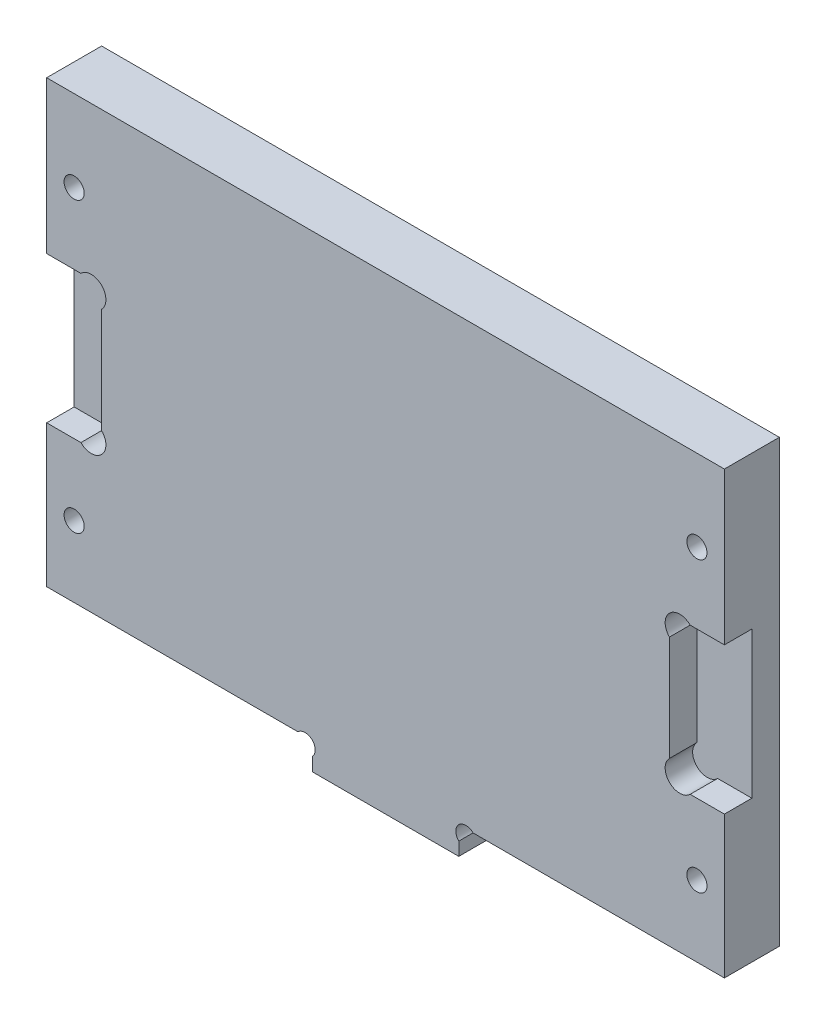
ISO-10303-21;
HEADER;
FILE_DESCRIPTION(('STEP AP214'),'2;1');
FILE_NAME('part.step','',(''),(''),'','','');
FILE_SCHEMA(('AUTOMOTIVE_DESIGN { 1 0 10303 214 1 1 1 1 }'));
ENDSEC;
DATA;
#1=APPLICATION_CONTEXT('core data for automotive mechanical design processes');
#2=APPLICATION_PROTOCOL_DEFINITION('international standard','automotive_design',2000,#1);
#3=PRODUCT_CONTEXT('',#1,'mechanical');
#4=PRODUCT('Part','Part','',(#3));
#5=PRODUCT_RELATED_PRODUCT_CATEGORY('part','',(#4));
#6=PRODUCT_DEFINITION_FORMATION('','',#4);
#7=PRODUCT_DEFINITION_CONTEXT('part definition',#1,'design');
#8=PRODUCT_DEFINITION('design','',#6,#7);
#9=PRODUCT_DEFINITION_SHAPE('','',#8);
#10=(LENGTH_UNIT() NAMED_UNIT(*) SI_UNIT(.MILLI.,.METRE.));
#11=(NAMED_UNIT(*) PLANE_ANGLE_UNIT() SI_UNIT($,.RADIAN.));
#12=(NAMED_UNIT(*) SI_UNIT($,.STERADIAN.) SOLID_ANGLE_UNIT());
#13=UNCERTAINTY_MEASURE_WITH_UNIT(LENGTH_MEASURE(1.E-05),#10,'distance_accuracy_value','');
#14=(GEOMETRIC_REPRESENTATION_CONTEXT(3) GLOBAL_UNCERTAINTY_ASSIGNED_CONTEXT((#13)) GLOBAL_UNIT_ASSIGNED_CONTEXT((#10,
#11,#12)) REPRESENTATION_CONTEXT('',''));
#15=CARTESIAN_POINT('',(0.,0.,0.));
#16=DIRECTION('',(0.,0.,1.));
#17=DIRECTION('',(1.,0.,0.));
#18=AXIS2_PLACEMENT_3D('',#15,#16,#17);
#19=CARTESIAN_POINT('',(28.2221825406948,2.2221825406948,6.));
#20=DIRECTION('',(0.,0.,-1.));
#21=DIRECTION('',(-1.,0.,0.));
#22=AXIS2_PLACEMENT_3D('',#19,#20,#21);
#23=PLANE('',#22);
#24=CARTESIAN_POINT('',(4.86862915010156,19.6313708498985,6.));
#25=DIRECTION('',(0.,0.,1.));
#26=DIRECTION('',(1.,0.,0.));
#27=AXIS2_PLACEMENT_3D('',#24,#25,#26);
#28=CIRCLE('',#27,1.59999999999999);
#29=CARTESIAN_POINT('',(3.73725830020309,18.5,6.));
#30=VERTEX_POINT('',#29);
#31=CARTESIAN_POINT('',(6.00000000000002,20.762741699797,6.));
#32=VERTEX_POINT('',#31);
#33=EDGE_CURVE('E191',#30,#32,#28,.T.);
#34=ORIENTED_EDGE('',*,*,#33,.F.);
#35=DIRECTION('',(1.,0.,0.));
#36=VECTOR('',#35,1.);
#37=CARTESIAN_POINT('',(3.73725830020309,18.5,6.));
#38=LINE('',#37,#36);
#39=CARTESIAN_POINT('',(0.,18.5,6.));
#40=VERTEX_POINT('',#39);
#41=EDGE_CURVE('E206',#40,#30,#38,.T.);
#42=ORIENTED_EDGE('',*,*,#41,.F.);
#43=DIRECTION('',(0.,-1.,0.));
#44=VECTOR('',#43,1.);
#45=CARTESIAN_POINT('',(0.,51.13,6.));
#46=LINE('',#45,#44);
#47=CARTESIAN_POINT('',(0.,3.,6.));
#48=VERTEX_POINT('',#47);
#49=EDGE_CURVE('E304',#40,#48,#46,.T.);
#50=ORIENTED_EDGE('',*,*,#49,.T.);
#51=DIRECTION('',(1.,0.,0.));
#52=VECTOR('',#51,1.);
#53=CARTESIAN_POINT('',(27.4443650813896,3.,6.));
#54=LINE('',#53,#52);
#55=CARTESIAN_POINT('',(27.4443650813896,3.,6.));
#56=VERTEX_POINT('',#55);
#57=EDGE_CURVE('E303',#48,#56,#54,.T.);
#58=ORIENTED_EDGE('',*,*,#57,.T.);
#59=CARTESIAN_POINT('',(28.2221825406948,2.2221825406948,6.));
#60=DIRECTION('',(0.,0.,-1.));
#61=DIRECTION('',(-1.,0.,0.));
#62=AXIS2_PLACEMENT_3D('',#59,#60,#61);
#63=CIRCLE('',#62,1.09999999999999);
#64=CARTESIAN_POINT('',(29.,1.4443650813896,6.));
#65=VERTEX_POINT('',#64);
#66=EDGE_CURVE('E306',#56,#65,#63,.T.);
#67=ORIENTED_EDGE('',*,*,#66,.T.);
#68=DIRECTION('',(0.,-1.,0.));
#69=VECTOR('',#68,1.);
#70=CARTESIAN_POINT('',(29.,1.4443650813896,6.));
#71=LINE('',#70,#69);
#72=CARTESIAN_POINT('',(29.,0.,6.));
#73=VERTEX_POINT('',#72);
#74=EDGE_CURVE('E308',#65,#73,#71,.T.);
#75=ORIENTED_EDGE('',*,*,#74,.T.);
#76=DIRECTION('',(1.,0.,0.));
#77=VECTOR('',#76,1.);
#78=CARTESIAN_POINT('',(29.,0.,6.));
#79=LINE('',#78,#77);
#80=CARTESIAN_POINT('',(45.,0.,6.));
#81=VERTEX_POINT('',#80);
#82=EDGE_CURVE('E310',#73,#81,#79,.T.);
#83=ORIENTED_EDGE('',*,*,#82,.T.);
#84=DIRECTION('',(0.,1.,0.));
#85=VECTOR('',#84,1.);
#86=CARTESIAN_POINT('',(45.,1.44436508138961,6.));
#87=LINE('',#86,#85);
#88=CARTESIAN_POINT('',(45.,1.4443650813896,6.));
#89=VERTEX_POINT('',#88);
#90=EDGE_CURVE('E312',#81,#89,#87,.T.);
#91=ORIENTED_EDGE('',*,*,#90,.T.);
#92=CARTESIAN_POINT('',(45.7778174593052,2.2221825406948,6.));
#93=DIRECTION('',(0.,0.,-1.));
#94=DIRECTION('',(1.,0.,0.));
#95=AXIS2_PLACEMENT_3D('',#92,#93,#94);
#96=CIRCLE('',#95,1.09999999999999);
#97=CARTESIAN_POINT('',(46.5556349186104,3.,6.));
#98=VERTEX_POINT('',#97);
#99=EDGE_CURVE('E314',#89,#98,#96,.T.);
#100=ORIENTED_EDGE('',*,*,#99,.T.);
#101=DIRECTION('',(1.,0.,0.));
#102=VECTOR('',#101,1.);
#103=CARTESIAN_POINT('',(46.5556349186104,3.,6.));
#104=LINE('',#103,#102);
#105=CARTESIAN_POINT('',(74.,3.00000000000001,6.));
#106=VERTEX_POINT('',#105);
#107=EDGE_CURVE('E316',#98,#106,#104,.T.);
#108=ORIENTED_EDGE('',*,*,#107,.T.);
#109=DIRECTION('',(0.,1.,0.));
#110=VECTOR('',#109,1.);
#111=CARTESIAN_POINT('',(74.,51.13,6.));
#112=LINE('',#111,#110);
#113=CARTESIAN_POINT('',(74.,18.5,6.));
#114=VERTEX_POINT('',#113);
#115=EDGE_CURVE('E319',#106,#114,#112,.T.);
#116=ORIENTED_EDGE('',*,*,#115,.T.);
#117=DIRECTION('',(1.,0.,0.));
#118=VECTOR('',#117,1.);
#119=CARTESIAN_POINT('',(70.2627416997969,18.5,6.));
#120=LINE('',#119,#118);
#121=CARTESIAN_POINT('',(70.2627416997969,18.5,6.));
#122=VERTEX_POINT('',#121);
#123=EDGE_CURVE('E259',#122,#114,#120,.T.);
#124=ORIENTED_EDGE('',*,*,#123,.F.);
#125=CARTESIAN_POINT('',(69.1313708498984,19.6313708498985,6.));
#126=DIRECTION('',(0.,0.,1.));
#127=DIRECTION('',(-1.,0.,0.));
#128=AXIS2_PLACEMENT_3D('',#125,#126,#127);
#129=CIRCLE('',#128,1.59999999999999);
#130=CARTESIAN_POINT('',(68.,20.762741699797,6.));
#131=VERTEX_POINT('',#130);
#132=EDGE_CURVE('E256',#131,#122,#129,.T.);
#133=ORIENTED_EDGE('',*,*,#132,.F.);
#134=DIRECTION('',(0.,-1.,0.));
#135=VECTOR('',#134,1.);
#136=CARTESIAN_POINT('',(68.,32.237258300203,6.));
#137=LINE('',#136,#135);
#138=CARTESIAN_POINT('',(68.,32.237258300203,6.));
#139=VERTEX_POINT('',#138);
#140=EDGE_CURVE('E253',#139,#131,#137,.T.);
#141=ORIENTED_EDGE('',*,*,#140,.F.);
#142=CARTESIAN_POINT('',(69.1313708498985,33.3686291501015,6.));
#143=DIRECTION('',(0.,0.,1.));
#144=DIRECTION('',(1.,0.,0.));
#145=AXIS2_PLACEMENT_3D('',#142,#143,#144);
#146=CIRCLE('',#145,1.59999999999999);
#147=CARTESIAN_POINT('',(70.2627416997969,34.5,6.));
#148=VERTEX_POINT('',#147);
#149=EDGE_CURVE('E226',#148,#139,#146,.T.);
#150=ORIENTED_EDGE('',*,*,#149,.F.);
#151=DIRECTION('',(-1.,0.,0.));
#152=VECTOR('',#151,1.);
#153=CARTESIAN_POINT('',(70.2627416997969,34.5,6.));
#154=LINE('',#153,#152);
#155=CARTESIAN_POINT('',(74.,34.5,6.));
#156=VERTEX_POINT('',#155);
#157=EDGE_CURVE('E239',#156,#148,#154,.T.);
#158=ORIENTED_EDGE('',*,*,#157,.F.);
#159=CARTESIAN_POINT('',(74.,51.13,6.));
#160=VERTEX_POINT('',#159);
#161=EDGE_CURVE('E318',#156,#160,#112,.T.);
#162=ORIENTED_EDGE('',*,*,#161,.T.);
#163=DIRECTION('',(-1.,0.,0.));
#164=VECTOR('',#163,1.);
#165=CARTESIAN_POINT('',(0.,51.13,6.));
#166=LINE('',#165,#164);
#167=CARTESIAN_POINT('',(0.,51.13,6.));
#168=VERTEX_POINT('',#167);
#169=EDGE_CURVE('E322',#160,#168,#166,.T.);
#170=ORIENTED_EDGE('',*,*,#169,.T.);
#171=CARTESIAN_POINT('',(0.,34.5,6.));
#172=VERTEX_POINT('',#171);
#173=EDGE_CURVE('E300',#168,#172,#46,.T.);
#174=ORIENTED_EDGE('',*,*,#173,.T.);
#175=DIRECTION('',(-1.,0.,0.));
#176=VECTOR('',#175,1.);
#177=CARTESIAN_POINT('',(3.73725830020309,34.5,6.));
#178=LINE('',#177,#176);
#179=CARTESIAN_POINT('',(3.73725830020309,34.5,6.));
#180=VERTEX_POINT('',#179);
#181=EDGE_CURVE('E209',#180,#172,#178,.T.);
#182=ORIENTED_EDGE('',*,*,#181,.F.);
#183=CARTESIAN_POINT('',(4.86862915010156,33.3686291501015,6.));
#184=DIRECTION('',(0.,0.,1.));
#185=DIRECTION('',(-1.,0.,0.));
#186=AXIS2_PLACEMENT_3D('',#183,#184,#185);
#187=CIRCLE('',#186,1.59999999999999);
#188=CARTESIAN_POINT('',(6.00000000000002,32.237258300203,6.));
#189=VERTEX_POINT('',#188);
#190=EDGE_CURVE('E220',#189,#180,#187,.T.);
#191=ORIENTED_EDGE('',*,*,#190,.F.);
#192=DIRECTION('',(0.,1.,0.));
#193=VECTOR('',#192,1.);
#194=CARTESIAN_POINT('',(6.00000000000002,32.237258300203,6.));
#195=LINE('',#194,#193);
#196=EDGE_CURVE('E218',#32,#189,#195,.T.);
#197=ORIENTED_EDGE('',*,*,#196,.F.);
#198=EDGE_LOOP('',(#34,#42,#50,#58,#67,#75,#83,#91,#100,#108,#116,#124,#133,#141,#150,#158,#162,
#170,#174,#182,#191,#197));
#199=FACE_BOUND('',#198,.T.);
#200=CARTESIAN_POINT('',(71.,10.75,6.));
#201=DIRECTION('',(0.,0.,1.));
#202=DIRECTION('',(1.,0.,0.));
#203=AXIS2_PLACEMENT_3D('',#200,#201,#202);
#204=CIRCLE('',#203,1.10000000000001);
#205=CARTESIAN_POINT('',(72.1,10.75,6.));
#206=VERTEX_POINT('',#205);
#207=EDGE_CURVE('E294',#206,#206,#204,.T.);
#208=ORIENTED_EDGE('',*,*,#207,.F.);
#209=EDGE_LOOP('',(#208));
#210=FACE_BOUND('',#209,.T.);
#211=CARTESIAN_POINT('',(71.,42.25,6.));
#212=DIRECTION('',(0.,0.,1.));
#213=DIRECTION('',(-1.,0.,0.));
#214=AXIS2_PLACEMENT_3D('',#211,#212,#213);
#215=CIRCLE('',#214,1.10000000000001);
#216=CARTESIAN_POINT('',(69.9,42.25,6.));
#217=VERTEX_POINT('',#216);
#218=EDGE_CURVE('E288',#217,#217,#215,.T.);
#219=ORIENTED_EDGE('',*,*,#218,.F.);
#220=EDGE_LOOP('',(#219));
#221=FACE_BOUND('',#220,.T.);
#222=CARTESIAN_POINT('',(3.,10.75,6.));
#223=DIRECTION('',(0.,0.,1.));
#224=DIRECTION('',(-1.,0.,0.));
#225=AXIS2_PLACEMENT_3D('',#222,#223,#224);
#226=CIRCLE('',#225,1.1);
#227=CARTESIAN_POINT('',(1.9,10.75,6.));
#228=VERTEX_POINT('',#227);
#229=EDGE_CURVE('E282',#228,#228,#226,.T.);
#230=ORIENTED_EDGE('',*,*,#229,.F.);
#231=EDGE_LOOP('',(#230));
#232=FACE_BOUND('',#231,.T.);
#233=CARTESIAN_POINT('',(3.,42.25,6.));
#234=DIRECTION('',(0.,0.,1.));
#235=DIRECTION('',(1.,0.,0.));
#236=AXIS2_PLACEMENT_3D('',#233,#234,#235);
#237=CIRCLE('',#236,1.09999999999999);
#238=CARTESIAN_POINT('',(4.1,42.25,6.));
#239=VERTEX_POINT('',#238);
#240=EDGE_CURVE('E276',#239,#239,#237,.T.);
#241=ORIENTED_EDGE('',*,*,#240,.F.);
#242=EDGE_LOOP('',(#241));
#243=FACE_BOUND('',#242,.T.);
#244=ADVANCED_FACE('F33',(#199,#210,#221,#232,#243),#23,.F.);
#245=CARTESIAN_POINT('',(28.2221825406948,2.2221825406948,0.));
#246=DIRECTION('',(0.,0.,-1.));
#247=DIRECTION('',(-1.,0.,0.));
#248=AXIS2_PLACEMENT_3D('',#245,#246,#247);
#249=PLANE('',#248);
#250=CARTESIAN_POINT('',(3.,10.75,0.));
#251=DIRECTION('',(0.,0.,1.));
#252=DIRECTION('',(-1.,0.,0.));
#253=AXIS2_PLACEMENT_3D('',#250,#251,#252);
#254=CIRCLE('',#253,1.1);
#255=CARTESIAN_POINT('',(1.9,10.75,0.));
#256=VERTEX_POINT('',#255);
#257=EDGE_CURVE('E279',#256,#256,#254,.T.);
#258=ORIENTED_EDGE('',*,*,#257,.T.);
#259=EDGE_LOOP('',(#258));
#260=FACE_BOUND('',#259,.T.);
#261=CARTESIAN_POINT('',(71.,10.75,0.));
#262=DIRECTION('',(0.,0.,1.));
#263=DIRECTION('',(1.,0.,0.));
#264=AXIS2_PLACEMENT_3D('',#261,#262,#263);
#265=CIRCLE('',#264,1.10000000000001);
#266=CARTESIAN_POINT('',(72.1,10.75,0.));
#267=VERTEX_POINT('',#266);
#268=EDGE_CURVE('E291',#267,#267,#265,.T.);
#269=ORIENTED_EDGE('',*,*,#268,.T.);
#270=EDGE_LOOP('',(#269));
#271=FACE_BOUND('',#270,.T.);
#272=DIRECTION('',(0.,-1.,0.));
#273=VECTOR('',#272,1.);
#274=CARTESIAN_POINT('',(0.,51.13,0.));
#275=LINE('',#274,#273);
#276=CARTESIAN_POINT('',(0.,51.13,0.));
#277=VERTEX_POINT('',#276);
#278=CARTESIAN_POINT('',(0.,3.,0.));
#279=VERTEX_POINT('',#278);
#280=EDGE_CURVE('E297',#277,#279,#275,.T.);
#281=ORIENTED_EDGE('',*,*,#280,.F.);
#282=DIRECTION('',(-1.,0.,0.));
#283=VECTOR('',#282,1.);
#284=CARTESIAN_POINT('',(0.,51.13,0.));
#285=LINE('',#284,#283);
#286=CARTESIAN_POINT('',(74.,51.13,0.));
#287=VERTEX_POINT('',#286);
#288=EDGE_CURVE('E343',#287,#277,#285,.T.);
#289=ORIENTED_EDGE('',*,*,#288,.F.);
#290=DIRECTION('',(0.,1.,0.));
#291=VECTOR('',#290,1.);
#292=CARTESIAN_POINT('',(74.,51.13,0.));
#293=LINE('',#292,#291);
#294=CARTESIAN_POINT('',(74.,3.00000000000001,0.));
#295=VERTEX_POINT('',#294);
#296=EDGE_CURVE('E341',#295,#287,#293,.T.);
#297=ORIENTED_EDGE('',*,*,#296,.F.);
#298=DIRECTION('',(1.,0.,0.));
#299=VECTOR('',#298,1.);
#300=CARTESIAN_POINT('',(46.5556349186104,3.,0.));
#301=LINE('',#300,#299);
#302=CARTESIAN_POINT('',(46.5556349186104,3.,0.));
#303=VERTEX_POINT('',#302);
#304=EDGE_CURVE('E339',#303,#295,#301,.T.);
#305=ORIENTED_EDGE('',*,*,#304,.F.);
#306=CARTESIAN_POINT('',(45.7778174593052,2.2221825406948,0.));
#307=DIRECTION('',(0.,0.,-1.));
#308=DIRECTION('',(1.,0.,0.));
#309=AXIS2_PLACEMENT_3D('',#306,#307,#308);
#310=CIRCLE('',#309,1.09999999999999);
#311=CARTESIAN_POINT('',(45.,1.4443650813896,0.));
#312=VERTEX_POINT('',#311);
#313=EDGE_CURVE('E337',#312,#303,#310,.T.);
#314=ORIENTED_EDGE('',*,*,#313,.F.);
#315=DIRECTION('',(0.,1.,0.));
#316=VECTOR('',#315,1.);
#317=CARTESIAN_POINT('',(45.,1.44436508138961,0.));
#318=LINE('',#317,#316);
#319=CARTESIAN_POINT('',(45.,0.,0.));
#320=VERTEX_POINT('',#319);
#321=EDGE_CURVE('E335',#320,#312,#318,.T.);
#322=ORIENTED_EDGE('',*,*,#321,.F.);
#323=DIRECTION('',(1.,0.,0.));
#324=VECTOR('',#323,1.);
#325=CARTESIAN_POINT('',(29.,0.,0.));
#326=LINE('',#325,#324);
#327=CARTESIAN_POINT('',(29.,0.,0.));
#328=VERTEX_POINT('',#327);
#329=EDGE_CURVE('E333',#328,#320,#326,.T.);
#330=ORIENTED_EDGE('',*,*,#329,.F.);
#331=DIRECTION('',(0.,-1.,0.));
#332=VECTOR('',#331,1.);
#333=CARTESIAN_POINT('',(29.,1.4443650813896,0.));
#334=LINE('',#333,#332);
#335=CARTESIAN_POINT('',(29.,1.4443650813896,0.));
#336=VERTEX_POINT('',#335);
#337=EDGE_CURVE('E331',#336,#328,#334,.T.);
#338=ORIENTED_EDGE('',*,*,#337,.F.);
#339=CARTESIAN_POINT('',(28.2221825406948,2.2221825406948,0.));
#340=DIRECTION('',(0.,0.,-1.));
#341=DIRECTION('',(-1.,0.,0.));
#342=AXIS2_PLACEMENT_3D('',#339,#340,#341);
#343=CIRCLE('',#342,1.09999999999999);
#344=CARTESIAN_POINT('',(27.4443650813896,3.,0.));
#345=VERTEX_POINT('',#344);
#346=EDGE_CURVE('E329',#345,#336,#343,.T.);
#347=ORIENTED_EDGE('',*,*,#346,.F.);
#348=DIRECTION('',(1.,0.,0.));
#349=VECTOR('',#348,1.);
#350=CARTESIAN_POINT('',(27.4443650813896,3.,0.));
#351=LINE('',#350,#349);
#352=EDGE_CURVE('E327',#279,#345,#351,.T.);
#353=ORIENTED_EDGE('',*,*,#352,.F.);
#354=EDGE_LOOP('',(#281,#289,#297,#305,#314,#322,#330,#338,#347,#353));
#355=FACE_BOUND('',#354,.T.);
#356=CARTESIAN_POINT('',(71.,42.25,0.));
#357=DIRECTION('',(0.,0.,1.));
#358=DIRECTION('',(-1.,0.,0.));
#359=AXIS2_PLACEMENT_3D('',#356,#357,#358);
#360=CIRCLE('',#359,1.10000000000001);
#361=CARTESIAN_POINT('',(69.9,42.25,0.));
#362=VERTEX_POINT('',#361);
#363=EDGE_CURVE('E285',#362,#362,#360,.T.);
#364=ORIENTED_EDGE('',*,*,#363,.T.);
#365=EDGE_LOOP('',(#364));
#366=FACE_BOUND('',#365,.T.);
#367=CARTESIAN_POINT('',(3.,42.25,0.));
#368=DIRECTION('',(0.,0.,1.));
#369=DIRECTION('',(1.,0.,0.));
#370=AXIS2_PLACEMENT_3D('',#367,#368,#369);
#371=CIRCLE('',#370,1.09999999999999);
#372=CARTESIAN_POINT('',(4.1,42.25,0.));
#373=VERTEX_POINT('',#372);
#374=EDGE_CURVE('E265',#373,#373,#371,.T.);
#375=ORIENTED_EDGE('',*,*,#374,.T.);
#376=EDGE_LOOP('',(#375));
#377=FACE_BOUND('',#376,.T.);
#378=ADVANCED_FACE('F379',(#260,#271,#355,#366,#377),#249,.T.);
#379=CARTESIAN_POINT('',(0.,51.13,6.));
#380=DIRECTION('',(1.,0.,0.));
#381=DIRECTION('',(0.,0.,-1.));
#382=AXIS2_PLACEMENT_3D('',#379,#380,#381);
#383=PLANE('',#382);
#384=ORIENTED_EDGE('',*,*,#49,.F.);
#385=DIRECTION('',(0.,0.,1.));
#386=VECTOR('',#385,1.);
#387=CARTESIAN_POINT('',(0.,18.5,3.));
#388=LINE('',#387,#386);
#389=CARTESIAN_POINT('',(0.,18.5,3.));
#390=VERTEX_POINT('',#389);
#391=EDGE_CURVE('E227',#390,#40,#388,.T.);
#392=ORIENTED_EDGE('',*,*,#391,.F.);
#393=DIRECTION('',(0.,-1.,0.));
#394=VECTOR('',#393,1.);
#395=CARTESIAN_POINT('',(0.,34.5,3.));
#396=LINE('',#395,#394);
#397=CARTESIAN_POINT('',(0.,34.5,3.));
#398=VERTEX_POINT('',#397);
#399=EDGE_CURVE('E214',#398,#390,#396,.T.);
#400=ORIENTED_EDGE('',*,*,#399,.F.);
#401=DIRECTION('',(0.,0.,1.));
#402=VECTOR('',#401,1.);
#403=CARTESIAN_POINT('',(0.,34.5,3.));
#404=LINE('',#403,#402);
#405=EDGE_CURVE('E229',#398,#172,#404,.T.);
#406=ORIENTED_EDGE('',*,*,#405,.T.);
#407=ORIENTED_EDGE('',*,*,#173,.F.);
#408=DIRECTION('',(0.,0.,-1.));
#409=VECTOR('',#408,1.);
#410=CARTESIAN_POINT('',(0.,51.13,6.));
#411=LINE('',#410,#409);
#412=EDGE_CURVE('E324',#168,#277,#411,.T.);
#413=ORIENTED_EDGE('',*,*,#412,.T.);
#414=ORIENTED_EDGE('',*,*,#280,.T.);
#415=DIRECTION('',(0.,0.,-1.));
#416=VECTOR('',#415,1.);
#417=CARTESIAN_POINT('',(0.,3.,6.));
#418=LINE('',#417,#416);
#419=EDGE_CURVE('E11',#48,#279,#418,.T.);
#420=ORIENTED_EDGE('',*,*,#419,.F.);
#421=EDGE_LOOP('',(#384,#392,#400,#406,#407,#413,#414,#420));
#422=FACE_BOUND('',#421,.T.);
#423=ADVANCED_FACE('F35',(#422),#383,.F.);
#424=CARTESIAN_POINT('',(27.4443650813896,3.,6.));
#425=DIRECTION('',(0.,1.,0.));
#426=DIRECTION('',(-1.,0.,0.));
#427=AXIS2_PLACEMENT_3D('',#424,#425,#426);
#428=PLANE('',#427);
#429=ORIENTED_EDGE('',*,*,#352,.T.);
#430=DIRECTION('',(0.,0.,-1.));
#431=VECTOR('',#430,1.);
#432=CARTESIAN_POINT('',(27.4443650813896,3.,6.));
#433=LINE('',#432,#431);
#434=EDGE_CURVE('E41',#56,#345,#433,.T.);
#435=ORIENTED_EDGE('',*,*,#434,.F.);
#436=ORIENTED_EDGE('',*,*,#57,.F.);
#437=ORIENTED_EDGE('',*,*,#419,.T.);
#438=EDGE_LOOP('',(#429,#435,#436,#437));
#439=FACE_BOUND('',#438,.T.);
#440=ADVANCED_FACE('F398',(#439),#428,.F.);
#441=CARTESIAN_POINT('',(28.2221825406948,2.2221825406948,6.));
#442=DIRECTION('',(0.,0.,-1.));
#443=DIRECTION('',(-1.,0.,0.));
#444=AXIS2_PLACEMENT_3D('',#441,#442,#443);
#445=CYLINDRICAL_SURFACE('',#444,1.09999999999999);
#446=ORIENTED_EDGE('',*,*,#346,.T.);
#447=DIRECTION('',(0.,0.,-1.));
#448=VECTOR('',#447,1.);
#449=CARTESIAN_POINT('',(29.,1.4443650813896,6.));
#450=LINE('',#449,#448);
#451=EDGE_CURVE('E365',#65,#336,#450,.T.);
#452=ORIENTED_EDGE('',*,*,#451,.F.);
#453=ORIENTED_EDGE('',*,*,#66,.F.);
#454=ORIENTED_EDGE('',*,*,#434,.T.);
#455=EDGE_LOOP('',(#446,#452,#453,#454));
#456=FACE_BOUND('',#455,.T.);
#457=ADVANCED_FACE('F372',(#456),#445,.F.);
#458=CARTESIAN_POINT('',(29.,1.4443650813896,6.));
#459=DIRECTION('',(1.,0.,0.));
#460=DIRECTION('',(0.,0.,-1.));
#461=AXIS2_PLACEMENT_3D('',#458,#459,#460);
#462=PLANE('',#461);
#463=ORIENTED_EDGE('',*,*,#337,.T.);
#464=DIRECTION('',(0.,0.,-1.));
#465=VECTOR('',#464,1.);
#466=CARTESIAN_POINT('',(29.,0.,6.));
#467=LINE('',#466,#465);
#468=EDGE_CURVE('E362',#73,#328,#467,.T.);
#469=ORIENTED_EDGE('',*,*,#468,.F.);
#470=ORIENTED_EDGE('',*,*,#74,.F.);
#471=ORIENTED_EDGE('',*,*,#451,.T.);
#472=EDGE_LOOP('',(#463,#469,#470,#471));
#473=FACE_BOUND('',#472,.T.);
#474=ADVANCED_FACE('F385',(#473),#462,.F.);
#475=CARTESIAN_POINT('',(29.,0.,6.));
#476=DIRECTION('',(0.,1.,0.));
#477=DIRECTION('',(-1.,0.,0.));
#478=AXIS2_PLACEMENT_3D('',#475,#476,#477);
#479=PLANE('',#478);
#480=ORIENTED_EDGE('',*,*,#329,.T.);
#481=DIRECTION('',(0.,0.,-1.));
#482=VECTOR('',#481,1.);
#483=CARTESIAN_POINT('',(45.,0.,6.));
#484=LINE('',#483,#482);
#485=EDGE_CURVE('E359',#81,#320,#484,.T.);
#486=ORIENTED_EDGE('',*,*,#485,.F.);
#487=ORIENTED_EDGE('',*,*,#82,.F.);
#488=ORIENTED_EDGE('',*,*,#468,.T.);
#489=EDGE_LOOP('',(#480,#486,#487,#488));
#490=FACE_BOUND('',#489,.T.);
#491=ADVANCED_FACE('F389',(#490),#479,.F.);
#492=CARTESIAN_POINT('',(45.,1.44436508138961,6.));
#493=DIRECTION('',(-1.,0.,0.));
#494=DIRECTION('',(0.,-1.,0.));
#495=AXIS2_PLACEMENT_3D('',#492,#493,#494);
#496=PLANE('',#495);
#497=ORIENTED_EDGE('',*,*,#321,.T.);
#498=DIRECTION('',(0.,0.,-1.));
#499=VECTOR('',#498,1.);
#500=CARTESIAN_POINT('',(45.,1.4443650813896,6.));
#501=LINE('',#500,#499);
#502=EDGE_CURVE('E356',#89,#312,#501,.T.);
#503=ORIENTED_EDGE('',*,*,#502,.F.);
#504=ORIENTED_EDGE('',*,*,#90,.F.);
#505=ORIENTED_EDGE('',*,*,#485,.T.);
#506=EDGE_LOOP('',(#497,#503,#504,#505));
#507=FACE_BOUND('',#506,.T.);
#508=ADVANCED_FACE('F425',(#507),#496,.F.);
#509=CARTESIAN_POINT('',(45.7778174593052,2.2221825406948,6.));
#510=DIRECTION('',(0.,0.,-1.));
#511=DIRECTION('',(-1.,0.,0.));
#512=AXIS2_PLACEMENT_3D('',#509,#510,#511);
#513=CYLINDRICAL_SURFACE('',#512,1.09999999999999);
#514=ORIENTED_EDGE('',*,*,#313,.T.);
#515=DIRECTION('',(0.,0.,-1.));
#516=VECTOR('',#515,1.);
#517=CARTESIAN_POINT('',(46.5556349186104,3.,6.));
#518=LINE('',#517,#516);
#519=EDGE_CURVE('E353',#98,#303,#518,.T.);
#520=ORIENTED_EDGE('',*,*,#519,.F.);
#521=ORIENTED_EDGE('',*,*,#99,.F.);
#522=ORIENTED_EDGE('',*,*,#502,.T.);
#523=EDGE_LOOP('',(#514,#520,#521,#522));
#524=FACE_BOUND('',#523,.T.);
#525=ADVANCED_FACE('F422',(#524),#513,.F.);
#526=CARTESIAN_POINT('',(46.5556349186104,3.,6.));
#527=DIRECTION('',(0.,1.,0.));
#528=DIRECTION('',(-1.,0.,0.));
#529=AXIS2_PLACEMENT_3D('',#526,#527,#528);
#530=PLANE('',#529);
#531=ORIENTED_EDGE('',*,*,#304,.T.);
#532=DIRECTION('',(0.,0.,-1.));
#533=VECTOR('',#532,1.);
#534=CARTESIAN_POINT('',(74.,3.00000000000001,6.));
#535=LINE('',#534,#533);
#536=EDGE_CURVE('E350',#106,#295,#535,.T.);
#537=ORIENTED_EDGE('',*,*,#536,.F.);
#538=ORIENTED_EDGE('',*,*,#107,.F.);
#539=ORIENTED_EDGE('',*,*,#519,.T.);
#540=EDGE_LOOP('',(#531,#537,#538,#539));
#541=FACE_BOUND('',#540,.T.);
#542=ADVANCED_FACE('F418',(#541),#530,.F.);
#543=CARTESIAN_POINT('',(74.,51.13,6.));
#544=DIRECTION('',(-1.,0.,0.));
#545=DIRECTION('',(0.,-1.,0.));
#546=AXIS2_PLACEMENT_3D('',#543,#544,#545);
#547=PLANE('',#546);
#548=ORIENTED_EDGE('',*,*,#161,.F.);
#549=DIRECTION('',(0.,0.,1.));
#550=VECTOR('',#549,1.);
#551=CARTESIAN_POINT('',(74.,34.5,3.));
#552=LINE('',#551,#550);
#553=CARTESIAN_POINT('',(74.,34.5,3.));
#554=VERTEX_POINT('',#553);
#555=EDGE_CURVE('E266',#554,#156,#552,.T.);
#556=ORIENTED_EDGE('',*,*,#555,.F.);
#557=DIRECTION('',(0.,1.,0.));
#558=VECTOR('',#557,1.);
#559=CARTESIAN_POINT('',(74.,34.5,3.));
#560=LINE('',#559,#558);
#561=CARTESIAN_POINT('',(74.,18.5,3.));
#562=VERTEX_POINT('',#561);
#563=EDGE_CURVE('E245',#562,#554,#560,.T.);
#564=ORIENTED_EDGE('',*,*,#563,.F.);
#565=DIRECTION('',(0.,0.,1.));
#566=VECTOR('',#565,1.);
#567=CARTESIAN_POINT('',(74.,18.5,3.));
#568=LINE('',#567,#566);
#569=EDGE_CURVE('E268',#562,#114,#568,.T.);
#570=ORIENTED_EDGE('',*,*,#569,.T.);
#571=ORIENTED_EDGE('',*,*,#115,.F.);
#572=ORIENTED_EDGE('',*,*,#536,.T.);
#573=ORIENTED_EDGE('',*,*,#296,.T.);
#574=DIRECTION('',(0.,0.,-1.));
#575=VECTOR('',#574,1.);
#576=CARTESIAN_POINT('',(74.,51.13,6.));
#577=LINE('',#576,#575);
#578=EDGE_CURVE('E347',#160,#287,#577,.T.);
#579=ORIENTED_EDGE('',*,*,#578,.F.);
#580=EDGE_LOOP('',(#548,#556,#564,#570,#571,#572,#573,#579));
#581=FACE_BOUND('',#580,.T.);
#582=ADVANCED_FACE('F412',(#581),#547,.F.);
#583=CARTESIAN_POINT('',(0.,51.13,6.));
#584=DIRECTION('',(0.,-1.,0.));
#585=DIRECTION('',(0.,0.,-1.));
#586=AXIS2_PLACEMENT_3D('',#583,#584,#585);
#587=PLANE('',#586);
#588=ORIENTED_EDGE('',*,*,#288,.T.);
#589=ORIENTED_EDGE('',*,*,#412,.F.);
#590=ORIENTED_EDGE('',*,*,#169,.F.);
#591=ORIENTED_EDGE('',*,*,#578,.T.);
#592=EDGE_LOOP('',(#588,#589,#590,#591));
#593=FACE_BOUND('',#592,.T.);
#594=ADVANCED_FACE('F407',(#593),#587,.F.);
#595=CARTESIAN_POINT('',(71.,10.75,6.));
#596=DIRECTION('',(0.,0.,-1.));
#597=DIRECTION('',(-1.,0.,0.));
#598=AXIS2_PLACEMENT_3D('',#595,#596,#597);
#599=CYLINDRICAL_SURFACE('',#598,1.10000000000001);
#600=ORIENTED_EDGE('',*,*,#207,.T.);
#601=EDGE_LOOP('',(#600));
#602=FACE_BOUND('',#601,.T.);
#603=ORIENTED_EDGE('',*,*,#268,.F.);
#604=EDGE_LOOP('',(#603));
#605=FACE_BOUND('',#604,.T.);
#606=ADVANCED_FACE('F442',(#602,#605),#599,.F.);
#607=CARTESIAN_POINT('',(71.,42.25,6.));
#608=DIRECTION('',(0.,0.,-1.));
#609=DIRECTION('',(-1.,0.,0.));
#610=AXIS2_PLACEMENT_3D('',#607,#608,#609);
#611=CYLINDRICAL_SURFACE('',#610,1.10000000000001);
#612=ORIENTED_EDGE('',*,*,#218,.T.);
#613=EDGE_LOOP('',(#612));
#614=FACE_BOUND('',#613,.T.);
#615=ORIENTED_EDGE('',*,*,#363,.F.);
#616=EDGE_LOOP('',(#615));
#617=FACE_BOUND('',#616,.T.);
#618=ADVANCED_FACE('F470',(#614,#617),#611,.F.);
#619=CARTESIAN_POINT('',(3.,10.75,6.));
#620=DIRECTION('',(0.,0.,-1.));
#621=DIRECTION('',(-1.,0.,0.));
#622=AXIS2_PLACEMENT_3D('',#619,#620,#621);
#623=CYLINDRICAL_SURFACE('',#622,1.1);
#624=ORIENTED_EDGE('',*,*,#229,.T.);
#625=EDGE_LOOP('',(#624));
#626=FACE_BOUND('',#625,.T.);
#627=ORIENTED_EDGE('',*,*,#257,.F.);
#628=EDGE_LOOP('',(#627));
#629=FACE_BOUND('',#628,.T.);
#630=ADVANCED_FACE('F477',(#626,#629),#623,.F.);
#631=CARTESIAN_POINT('',(3.,42.25,6.));
#632=DIRECTION('',(0.,0.,-1.));
#633=DIRECTION('',(-1.,0.,0.));
#634=AXIS2_PLACEMENT_3D('',#631,#632,#633);
#635=CYLINDRICAL_SURFACE('',#634,1.09999999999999);
#636=ORIENTED_EDGE('',*,*,#240,.T.);
#637=EDGE_LOOP('',(#636));
#638=FACE_BOUND('',#637,.T.);
#639=ORIENTED_EDGE('',*,*,#374,.F.);
#640=EDGE_LOOP('',(#639));
#641=FACE_BOUND('',#640,.T.);
#642=ADVANCED_FACE('F484',(#638,#641),#635,.F.);
#643=CARTESIAN_POINT('',(69.1313708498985,33.3686291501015,3.));
#644=DIRECTION('',(0.,0.,1.));
#645=DIRECTION('',(1.,0.,0.));
#646=AXIS2_PLACEMENT_3D('',#643,#644,#645);
#647=CYLINDRICAL_SURFACE('',#646,1.59999999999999);
#648=ORIENTED_EDGE('',*,*,#149,.T.);
#649=DIRECTION('',(0.,0.,1.));
#650=VECTOR('',#649,1.);
#651=CARTESIAN_POINT('',(68.,32.237258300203,3.));
#652=LINE('',#651,#650);
#653=CARTESIAN_POINT('',(68.,32.237258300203,3.));
#654=VERTEX_POINT('',#653);
#655=EDGE_CURVE('E250',#654,#139,#652,.T.);
#656=ORIENTED_EDGE('',*,*,#655,.F.);
#657=CARTESIAN_POINT('',(69.1313708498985,33.3686291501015,3.));
#658=DIRECTION('',(0.,0.,1.));
#659=DIRECTION('',(1.,0.,0.));
#660=AXIS2_PLACEMENT_3D('',#657,#658,#659);
#661=CIRCLE('',#660,1.59999999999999);
#662=CARTESIAN_POINT('',(70.2627416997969,34.5,3.));
#663=VERTEX_POINT('',#662);
#664=EDGE_CURVE('E235',#663,#654,#661,.T.);
#665=ORIENTED_EDGE('',*,*,#664,.F.);
#666=DIRECTION('',(0.,0.,1.));
#667=VECTOR('',#666,1.);
#668=CARTESIAN_POINT('',(70.2627416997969,34.5,3.));
#669=LINE('',#668,#667);
#670=EDGE_CURVE('E263',#663,#148,#669,.T.);
#671=ORIENTED_EDGE('',*,*,#670,.T.);
#672=EDGE_LOOP('',(#648,#656,#665,#671));
#673=FACE_BOUND('',#672,.T.);
#674=ADVANCED_FACE('F492',(#673),#647,.F.);
#675=CARTESIAN_POINT('',(70.2627416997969,34.5,3.));
#676=DIRECTION('',(0.,1.,0.));
#677=DIRECTION('',(-1.,0.,0.));
#678=AXIS2_PLACEMENT_3D('',#675,#676,#677);
#679=PLANE('',#678);
#680=ORIENTED_EDGE('',*,*,#157,.T.);
#681=ORIENTED_EDGE('',*,*,#670,.F.);
#682=DIRECTION('',(-1.,0.,0.));
#683=VECTOR('',#682,1.);
#684=CARTESIAN_POINT('',(70.2627416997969,34.5,3.));
#685=LINE('',#684,#683);
#686=EDGE_CURVE('E247',#554,#663,#685,.T.);
#687=ORIENTED_EDGE('',*,*,#686,.F.);
#688=ORIENTED_EDGE('',*,*,#555,.T.);
#689=EDGE_LOOP('',(#680,#681,#687,#688));
#690=FACE_BOUND('',#689,.T.);
#691=ADVANCED_FACE('F499',(#690),#679,.F.);
#692=CARTESIAN_POINT('',(70.2627416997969,18.5,3.));
#693=DIRECTION('',(0.,-1.,0.));
#694=DIRECTION('',(1.,0.,0.));
#695=AXIS2_PLACEMENT_3D('',#692,#693,#694);
#696=PLANE('',#695);
#697=ORIENTED_EDGE('',*,*,#123,.T.);
#698=ORIENTED_EDGE('',*,*,#569,.F.);
#699=DIRECTION('',(1.,0.,0.));
#700=VECTOR('',#699,1.);
#701=CARTESIAN_POINT('',(70.2627416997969,18.5,3.));
#702=LINE('',#701,#700);
#703=CARTESIAN_POINT('',(70.2627416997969,18.5,3.));
#704=VERTEX_POINT('',#703);
#705=EDGE_CURVE('E56',#704,#562,#702,.T.);
#706=ORIENTED_EDGE('',*,*,#705,.F.);
#707=DIRECTION('',(0.,0.,1.));
#708=VECTOR('',#707,1.);
#709=CARTESIAN_POINT('',(70.2627416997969,18.5,3.));
#710=LINE('',#709,#708);
#711=EDGE_CURVE('E271',#704,#122,#710,.T.);
#712=ORIENTED_EDGE('',*,*,#711,.T.);
#713=EDGE_LOOP('',(#697,#698,#706,#712));
#714=FACE_BOUND('',#713,.T.);
#715=ADVANCED_FACE('F507',(#714),#696,.F.);
#716=CARTESIAN_POINT('',(69.1313708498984,19.6313708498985,3.));
#717=DIRECTION('',(0.,0.,1.));
#718=DIRECTION('',(1.,0.,0.));
#719=AXIS2_PLACEMENT_3D('',#716,#717,#718);
#720=CYLINDRICAL_SURFACE('',#719,1.59999999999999);
#721=ORIENTED_EDGE('',*,*,#132,.T.);
#722=ORIENTED_EDGE('',*,*,#711,.F.);
#723=CARTESIAN_POINT('',(69.1313708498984,19.6313708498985,3.));
#724=DIRECTION('',(0.,0.,1.));
#725=DIRECTION('',(-1.,0.,0.));
#726=AXIS2_PLACEMENT_3D('',#723,#724,#725);
#727=CIRCLE('',#726,1.59999999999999);
#728=CARTESIAN_POINT('',(68.,20.762741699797,3.));
#729=VERTEX_POINT('',#728);
#730=EDGE_CURVE('E242',#729,#704,#727,.T.);
#731=ORIENTED_EDGE('',*,*,#730,.F.);
#732=DIRECTION('',(0.,0.,1.));
#733=VECTOR('',#732,1.);
#734=CARTESIAN_POINT('',(68.,20.762741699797,3.));
#735=LINE('',#734,#733);
#736=EDGE_CURVE('E273',#729,#131,#735,.T.);
#737=ORIENTED_EDGE('',*,*,#736,.T.);
#738=EDGE_LOOP('',(#721,#722,#731,#737));
#739=FACE_BOUND('',#738,.T.);
#740=ADVANCED_FACE('F515',(#739),#720,.F.);
#741=CARTESIAN_POINT('',(68.,32.237258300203,3.));
#742=DIRECTION('',(-1.,0.,0.));
#743=DIRECTION('',(0.,0.,1.));
#744=AXIS2_PLACEMENT_3D('',#741,#742,#743);
#745=PLANE('',#744);
#746=ORIENTED_EDGE('',*,*,#140,.T.);
#747=ORIENTED_EDGE('',*,*,#736,.F.);
#748=DIRECTION('',(0.,-1.,0.));
#749=VECTOR('',#748,1.);
#750=CARTESIAN_POINT('',(68.,32.237258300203,3.));
#751=LINE('',#750,#749);
#752=EDGE_CURVE('E238',#654,#729,#751,.T.);
#753=ORIENTED_EDGE('',*,*,#752,.F.);
#754=ORIENTED_EDGE('',*,*,#655,.T.);
#755=EDGE_LOOP('',(#746,#747,#753,#754));
#756=FACE_BOUND('',#755,.T.);
#757=ADVANCED_FACE('F523',(#756),#745,.F.);
#758=CARTESIAN_POINT('',(69.1313708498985,33.3686291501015,3.));
#759=DIRECTION('',(0.,0.,1.));
#760=DIRECTION('',(1.,0.,0.));
#761=AXIS2_PLACEMENT_3D('',#758,#759,#760);
#762=PLANE('',#761);
#763=ORIENTED_EDGE('',*,*,#664,.T.);
#764=ORIENTED_EDGE('',*,*,#752,.T.);
#765=ORIENTED_EDGE('',*,*,#730,.T.);
#766=ORIENTED_EDGE('',*,*,#705,.T.);
#767=ORIENTED_EDGE('',*,*,#563,.T.);
#768=ORIENTED_EDGE('',*,*,#686,.T.);
#769=EDGE_LOOP('',(#763,#764,#765,#766,#767,#768));
#770=FACE_BOUND('',#769,.T.);
#771=ADVANCED_FACE('F531',(#770),#762,.T.);
#772=CARTESIAN_POINT('',(4.86862915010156,19.6313708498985,3.));
#773=DIRECTION('',(0.,0.,1.));
#774=DIRECTION('',(1.,0.,0.));
#775=AXIS2_PLACEMENT_3D('',#772,#773,#774);
#776=CYLINDRICAL_SURFACE('',#775,1.59999999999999);
#777=ORIENTED_EDGE('',*,*,#33,.T.);
#778=DIRECTION('',(0.,0.,1.));
#779=VECTOR('',#778,1.);
#780=CARTESIAN_POINT('',(6.00000000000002,20.762741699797,3.));
#781=LINE('',#780,#779);
#782=CARTESIAN_POINT('',(6.00000000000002,20.762741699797,3.));
#783=VERTEX_POINT('',#782);
#784=EDGE_CURVE('E184',#783,#32,#781,.T.);
#785=ORIENTED_EDGE('',*,*,#784,.F.);
#786=CARTESIAN_POINT('',(4.86862915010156,19.6313708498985,3.));
#787=DIRECTION('',(0.,0.,1.));
#788=DIRECTION('',(1.,0.,0.));
#789=AXIS2_PLACEMENT_3D('',#786,#787,#788);
#790=CIRCLE('',#789,1.59999999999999);
#791=CARTESIAN_POINT('',(3.73725830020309,18.5,3.));
#792=VERTEX_POINT('',#791);
#793=EDGE_CURVE('E188',#792,#783,#790,.T.);
#794=ORIENTED_EDGE('',*,*,#793,.F.);
#795=DIRECTION('',(0.,0.,1.));
#796=VECTOR('',#795,1.);
#797=CARTESIAN_POINT('',(3.73725830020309,18.5,3.));
#798=LINE('',#797,#796);
#799=EDGE_CURVE('E224',#792,#30,#798,.T.);
#800=ORIENTED_EDGE('',*,*,#799,.T.);
#801=EDGE_LOOP('',(#777,#785,#794,#800));
#802=FACE_BOUND('',#801,.T.);
#803=ADVANCED_FACE('F186',(#802),#776,.F.);
#804=CARTESIAN_POINT('',(3.73725830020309,18.5,3.));
#805=DIRECTION('',(0.,-1.,0.));
#806=DIRECTION('',(1.,0.,0.));
#807=AXIS2_PLACEMENT_3D('',#804,#805,#806);
#808=PLANE('',#807);
#809=ORIENTED_EDGE('',*,*,#41,.T.);
#810=ORIENTED_EDGE('',*,*,#799,.F.);
#811=DIRECTION('',(1.,0.,0.));
#812=VECTOR('',#811,1.);
#813=CARTESIAN_POINT('',(3.73725830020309,18.5,3.));
#814=LINE('',#813,#812);
#815=EDGE_CURVE('E196',#390,#792,#814,.T.);
#816=ORIENTED_EDGE('',*,*,#815,.F.);
#817=ORIENTED_EDGE('',*,*,#391,.T.);
#818=EDGE_LOOP('',(#809,#810,#816,#817));
#819=FACE_BOUND('',#818,.T.);
#820=ADVANCED_FACE('F545',(#819),#808,.F.);
#821=CARTESIAN_POINT('',(3.73725830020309,34.5,3.));
#822=DIRECTION('',(0.,1.,0.));
#823=DIRECTION('',(-1.,0.,0.));
#824=AXIS2_PLACEMENT_3D('',#821,#822,#823);
#825=PLANE('',#824);
#826=ORIENTED_EDGE('',*,*,#181,.T.);
#827=ORIENTED_EDGE('',*,*,#405,.F.);
#828=DIRECTION('',(-1.,0.,0.));
#829=VECTOR('',#828,1.);
#830=CARTESIAN_POINT('',(3.73725830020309,34.5,3.));
#831=LINE('',#830,#829);
#832=CARTESIAN_POINT('',(3.73725830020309,34.5,3.));
#833=VERTEX_POINT('',#832);
#834=EDGE_CURVE('E48',#833,#398,#831,.T.);
#835=ORIENTED_EDGE('',*,*,#834,.F.);
#836=DIRECTION('',(0.,0.,1.));
#837=VECTOR('',#836,1.);
#838=CARTESIAN_POINT('',(3.73725830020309,34.5,3.));
#839=LINE('',#838,#837);
#840=EDGE_CURVE('E232',#833,#180,#839,.T.);
#841=ORIENTED_EDGE('',*,*,#840,.T.);
#842=EDGE_LOOP('',(#826,#827,#835,#841));
#843=FACE_BOUND('',#842,.T.);
#844=ADVANCED_FACE('F552',(#843),#825,.F.);
#845=CARTESIAN_POINT('',(4.86862915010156,33.3686291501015,3.));
#846=DIRECTION('',(0.,0.,1.));
#847=DIRECTION('',(1.,0.,0.));
#848=AXIS2_PLACEMENT_3D('',#845,#846,#847);
#849=CYLINDRICAL_SURFACE('',#848,1.59999999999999);
#850=ORIENTED_EDGE('',*,*,#190,.T.);
#851=ORIENTED_EDGE('',*,*,#840,.F.);
#852=CARTESIAN_POINT('',(4.86862915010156,33.3686291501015,3.));
#853=DIRECTION('',(0.,0.,1.));
#854=DIRECTION('',(-1.,0.,0.));
#855=AXIS2_PLACEMENT_3D('',#852,#853,#854);
#856=CIRCLE('',#855,1.59999999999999);
#857=CARTESIAN_POINT('',(6.00000000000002,32.237258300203,3.));
#858=VERTEX_POINT('',#857);
#859=EDGE_CURVE('E202',#858,#833,#856,.T.);
#860=ORIENTED_EDGE('',*,*,#859,.F.);
#861=DIRECTION('',(0.,0.,1.));
#862=VECTOR('',#861,1.);
#863=CARTESIAN_POINT('',(6.00000000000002,32.237258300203,3.));
#864=LINE('',#863,#862);
#865=EDGE_CURVE('E195',#858,#189,#864,.T.);
#866=ORIENTED_EDGE('',*,*,#865,.T.);
#867=EDGE_LOOP('',(#850,#851,#860,#866));
#868=FACE_BOUND('',#867,.T.);
#869=ADVANCED_FACE('F560',(#868),#849,.F.);
#870=CARTESIAN_POINT('',(6.00000000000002,32.237258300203,3.));
#871=DIRECTION('',(1.,0.,0.));
#872=DIRECTION('',(0.,0.,-1.));
#873=AXIS2_PLACEMENT_3D('',#870,#871,#872);
#874=PLANE('',#873);
#875=ORIENTED_EDGE('',*,*,#196,.T.);
#876=ORIENTED_EDGE('',*,*,#865,.F.);
#877=DIRECTION('',(0.,1.,0.));
#878=VECTOR('',#877,1.);
#879=CARTESIAN_POINT('',(6.00000000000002,32.237258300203,3.));
#880=LINE('',#879,#878);
#881=EDGE_CURVE('E199',#783,#858,#880,.T.);
#882=ORIENTED_EDGE('',*,*,#881,.F.);
#883=ORIENTED_EDGE('',*,*,#784,.T.);
#884=EDGE_LOOP('',(#875,#876,#882,#883));
#885=FACE_BOUND('',#884,.T.);
#886=ADVANCED_FACE('F200',(#885),#874,.F.);
#887=CARTESIAN_POINT('',(4.86862915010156,19.6313708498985,3.));
#888=DIRECTION('',(0.,0.,1.));
#889=DIRECTION('',(1.,0.,0.));
#890=AXIS2_PLACEMENT_3D('',#887,#888,#889);
#891=PLANE('',#890);
#892=ORIENTED_EDGE('',*,*,#793,.T.);
#893=ORIENTED_EDGE('',*,*,#881,.T.);
#894=ORIENTED_EDGE('',*,*,#859,.T.);
#895=ORIENTED_EDGE('',*,*,#834,.T.);
#896=ORIENTED_EDGE('',*,*,#399,.T.);
#897=ORIENTED_EDGE('',*,*,#815,.T.);
#898=EDGE_LOOP('',(#892,#893,#894,#895,#896,#897));
#899=FACE_BOUND('',#898,.T.);
#900=ADVANCED_FACE('F204',(#899),#891,.T.);
#901=CLOSED_SHELL('',(#244,#378,#423,#440,#457,#474,#491,#508,#525,#542,#582,#594,#606,#618,
#630,#642,#674,#691,#715,#740,#757,#771,#803,#820,#844,#869,#886,#900));
#902=MANIFOLD_SOLID_BREP('B2',#901);
#903=ADVANCED_BREP_SHAPE_REPRESENTATION('',(#18,#902),#14);
#904=SHAPE_DEFINITION_REPRESENTATION(#9,#903);
ENDSEC;
END-ISO-10303-21;
